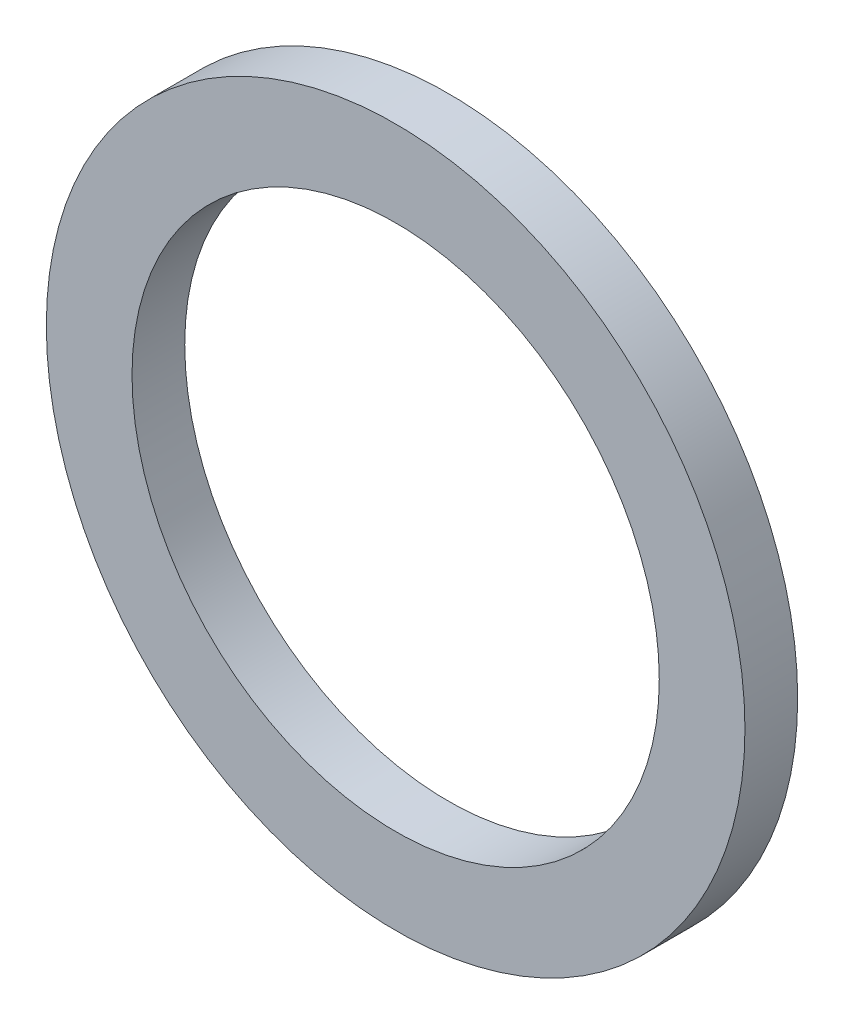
from build123d import *

# Parameters (mm, degrees)
SKETCH1_R      = 2.65
SKETCH1_R_2    = 2
EXTRUDE1_DEPTH = 0.4


with BuildPart() as part:
    # Sketch1 → Extrude1 (new body)
    with BuildSketch(Plane.XY):
        with Locations(Location((0, 0, 0), (0, 0, 180))):
            Circle(SKETCH1_R)
        with Locations(Location((0, 0, 0), (0, 0, 180))):
            Circle(SKETCH1_R_2, mode=Mode.SUBTRACT)
    extrude(amount=EXTRUDE1_DEPTH)


solid = part.part
